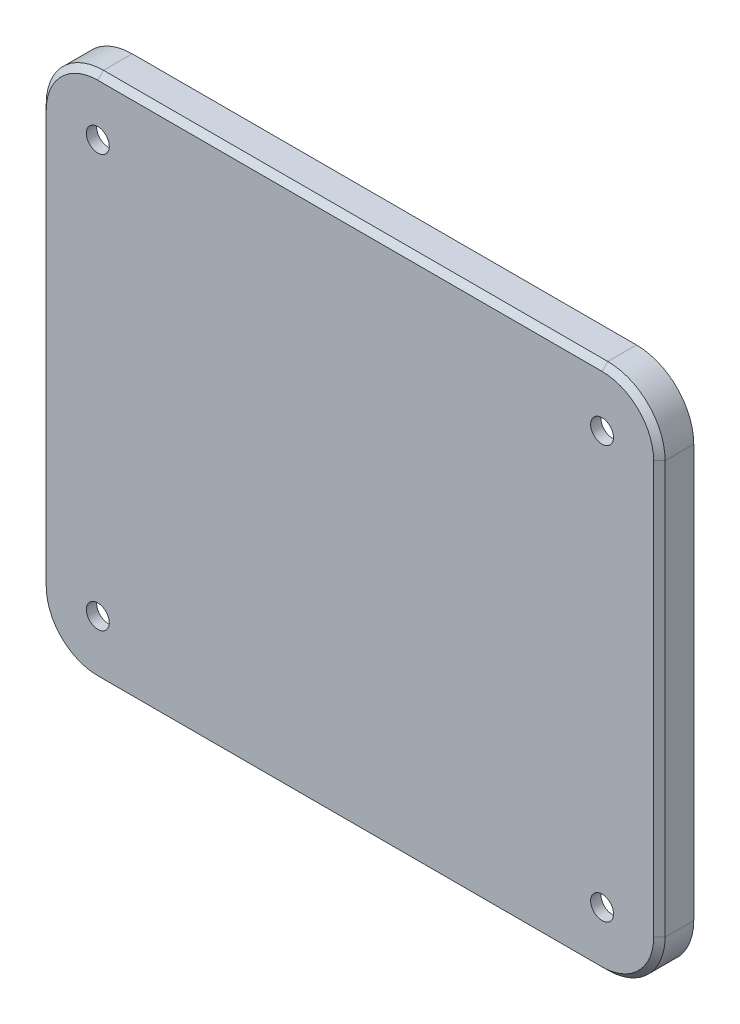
from build123d import *

# Parameters (mm, degrees)
ESQUISSE1_R        = 2
BOSS_EXTRU_1_DEPTH = 6
COQUE1_T           = -1.8
CONG_1_R           = 1.8
CHANFREIN1_SIZE    = 1


with BuildPart() as part:
    # Esquisse1 → Boss.-Extru.1 (new body)
    with BuildSketch(Plane.XY):
        with BuildLine():
            Line((44, -46), (-44, -46))
            ThreePointArc((-44, -46), (-51.071067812, -43.071067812), (-54, -36))
            Line((-54, -36), (-54, 36))
            ThreePointArc((-54, 36), (-51.071067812, 43.071067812), (-44, 46))
            Line((-44, 46), (44, 46))
            ThreePointArc((44, 46), (51.071067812, 43.071067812), (54, 36))
            Line((54, 36), (54, -36))
            ThreePointArc((54, -36), (51.071067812, -43.071067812), (44, -46))
        make_face()
        with Locations((-44, -36)):
            Circle(ESQUISSE1_R, mode=Mode.SUBTRACT)
        with Locations((44, -36)):
            Circle(ESQUISSE1_R, mode=Mode.SUBTRACT)
        with Locations((44, 36)):
            Circle(ESQUISSE1_R, mode=Mode.SUBTRACT)
        with Locations((-44, 36)):
            Circle(ESQUISSE1_R, mode=Mode.SUBTRACT)
    extrude(amount=BOSS_EXTRU_1_DEPTH)

    # Coque1
    coque1_openings = [part.faces().sort_by_distance(p)[0] for p in [
        (-46, -36, 3),
        (42, -36, 3),
        (42, 36, 3),
        (0, 0, 0),
        (-46, 36, 3),
    ]]
    offset(amount=COQUE1_T, openings=coque1_openings, kind=Kind.INTERSECTION)

    # Cong_1
    cong_1_edges = [part.edges().sort_by_distance(p)[0] for p in [
        (-49.798275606, -41.798275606, 4.2),
        (0, -44.2, 4.2),
        (49.798275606, -41.798275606, 4.2),
        (52.2, 0, 4.2),
        (49.798275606, 41.798275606, 4.2),
        (0, 44.2, 4.2),
        (-49.798275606, 41.798275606, 4.2),
        (-52.2, 0, 4.2),
    ]]
    fillet(cong_1_edges, radius=CONG_1_R)

    # Chanfrein1
    chanfrein1_edges = [part.edges().sort_by_distance(p)[0] for p in [
        (51.071067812, -43.071067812, 6),
        (54, 0, 6),
        (51.071067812, 43.071067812, 6),
        (0, 46, 6),
        (-51.071067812, 43.071067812, 6),
        (-54, 0, 6),
        (-51.071067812, -43.071067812, 6),
        (0, -46, 6),
    ]]
    chamfer(chanfrein1_edges, length=CHANFREIN1_SIZE)


solid = part.part
